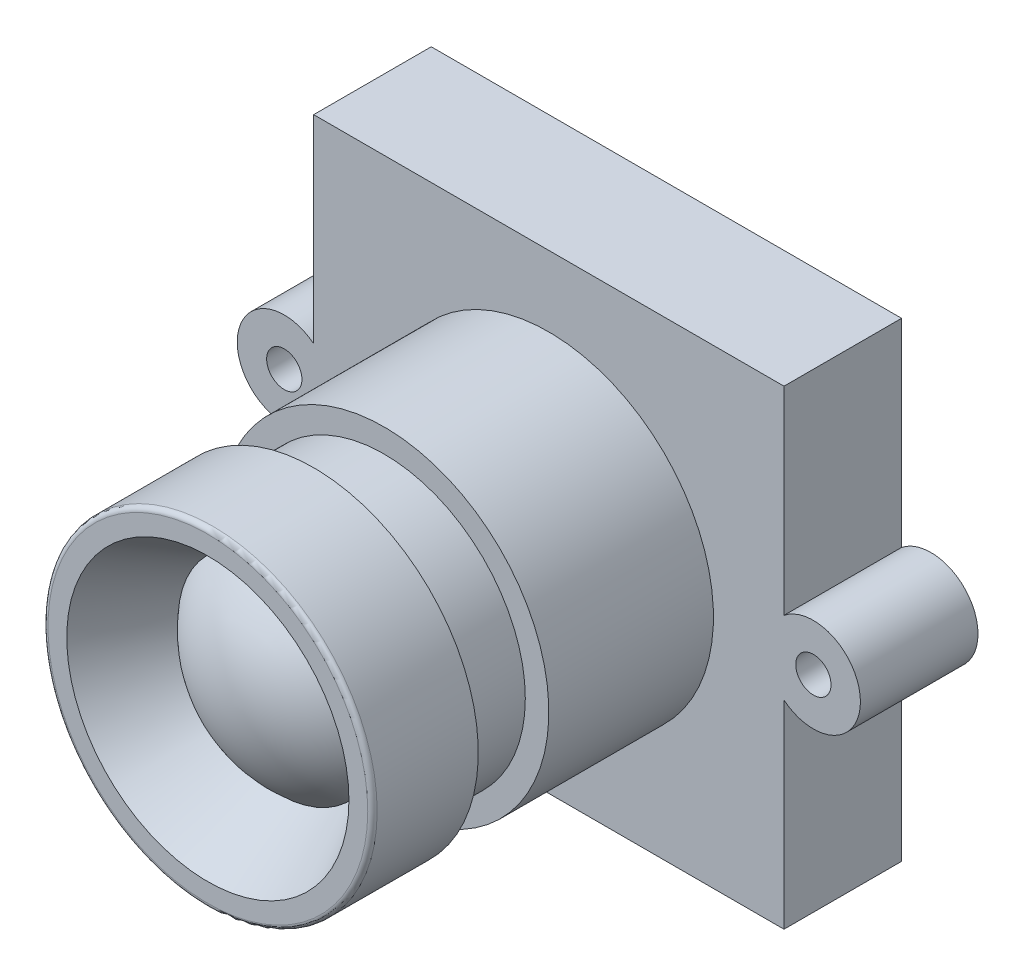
from build123d import *

# Parameters (mm, degrees)
ESQUISSE1_W             = 20
ESQUISSE1_H             = 20
EXTRUSION1_DEPTH        = 5
COQUE1_T                = -1
EXTRUSION2_DEPTH        = 5
ENL_V_MAT_EXTRU_1_REACH = 19.337
ESQUISSE3_R             = 0.75
ESQUISSE4_R             = 7
EXTRUSION3_DEPTH        = 14.5
ESQUISSE5_OUTSIDE_W     = 36.2
ESQUISSE5_OUTSIDE_H     = 29.7
ESQUISSE5_OUTSIDE_R     = 6
ENL_V_MAT_EXTRU_2_DEPTH = 3
ESQUISSE6_R             = 6
ENL_V_MAT_EXTRU_3_DEPTH = 3
ENL_V_MAT_EXTRU_3_DRAFT = -30
D_ME1_FACE_RADIUS       = 4.267949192
D_ME1_HEIGHT            = 2
ESQUISSE7_R             = 6.5
ENL_V_MAT_EXTRU_4_DEPTH = 1
ESQUISSE8_R             = 6
EXTRUSION4_DEPTH        = 0.5
ESQUISSE9_R             = 3
ENL_V_MAT_EXTRU_5_DEPTH = 1.5
ENL_V_MAT_EXTRU_5_DRAFT = -30
CONG_1_R                = 0.2


with BuildPart() as part:
    # Esquisse1 → Extrusion1 (new body)
    with BuildSketch(Plane.XY):
        Rectangle(ESQUISSE1_W, ESQUISSE1_H)
    extrude(amount=EXTRUSION1_DEPTH)

    # Coque1
    coque1_openings = [part.faces().sort_by_distance(p)[0] for p in [
        (0, 0, 0),
    ]]
    offset(amount=COQUE1_T, openings=coque1_openings, kind=Kind.INTERSECTION)

    # Esquisse2 → Extrusion2 (add)
    with BuildSketch(Plane.XY.offset(5)):
        with BuildLine():
            Line((10, -1.5612495), (10, 1.5612495))
            ThreePointArc((10, 1.5612495), (13.25, 0), (10, -1.5612495))
        make_face()
    extrusion2 = extrude(amount=-EXTRUSION2_DEPTH)

    # Esquisse3 → Enl_v. mat.-Extru.1 (cut, up to next)
    with BuildSketch(Plane.XY.offset(5), mode=Mode.PRIVATE) as enl_v_mat_extru_1_sk1:
        with Locations((11.25, 0)):
            Circle(ESQUISSE3_R)
    enl_v_mat_extru_1_tool1 = extrude(enl_v_mat_extru_1_sk1.sketch, amount=-ENL_V_MAT_EXTRU_1_REACH, mode=Mode.PRIVATE) & part.part
    enl_v_mat_extru_1 = enl_v_mat_extru_1_tool1.solids().sort_by_distance((11.25, 0, 5))[0]
    add(enl_v_mat_extru_1, mode=Mode.SUBTRACT)

    # Sym_trie1: Extrusion2, Enl_v. mat.-Extru.1 across plane
    add(extrusion2.mirror(Plane(origin=(0, 0, 0), x_dir=(0, 0, 1), z_dir=(1, 0, 0))))
    add(enl_v_mat_extru_1.mirror(Plane(origin=(0, 0, 0), x_dir=(0, 0, 1), z_dir=(1, 0, 0))), mode=Mode.SUBTRACT)

    # Esquisse4 → Extrusion3 (add)
    with BuildSketch(Plane.XY.offset(5)):
        with Locations(Location((0, 0, 0), (0, 0, 180))):
            Circle(ESQUISSE4_R)
    extrude(amount=EXTRUSION3_DEPTH)

    # Esquisse5 outside → Enl_v. mat.-Extru.2 (cut)
    with BuildSketch(Plane.XY.offset(15)):
        Rectangle(ESQUISSE5_OUTSIDE_W, ESQUISSE5_OUTSIDE_H)
        Circle(ESQUISSE5_OUTSIDE_R, mode=Mode.SUBTRACT)
    extrude(amount=-ENL_V_MAT_EXTRU_2_DEPTH, mode=Mode.SUBTRACT)


with BuildPart() as enl_v_mat_extru_3_tool:
    # Esquisse6 → Enl_v. mat.-Extru.3 (with draft: the straight prism first)
    with BuildSketch(Plane.XY.offset(19.5)):
        Circle(ESQUISSE6_R)
    extrude(amount=-ENL_V_MAT_EXTRU_3_DEPTH)
    # Enl_v. mat.-Extru.3: the draft: its side faces are tilted about the plane it starts from
    enl_v_mat_extru_3_sides = [enl_v_mat_extru_3_tool.faces().sort_by_distance(p)[0] for p in [
        (-6, 0, 18),
    ]]
    draft(enl_v_mat_extru_3_sides, Plane.XY.offset(19.5), ENL_V_MAT_EXTRU_3_DRAFT)


with BuildPart() as part_1:
    add(part.part)

    # Enl_v. mat.-Extru.3: cut by enl_v_mat_extru_3_tool
    add(enl_v_mat_extru_3_tool.part, mode=Mode.SUBTRACT)

    # D_me1: a dome of height H over a round flat face of radius A is a cap of a sphere of radius (A * A + H * H) / (2 * H)
    d_me1_r = (D_ME1_FACE_RADIUS * D_ME1_FACE_RADIUS + D_ME1_HEIGHT * D_ME1_HEIGHT) / (2 * D_ME1_HEIGHT)
    d_me1_base = Plane((0, 0, 16.5), z_dir=(0, 0, 1))
    with Locations(d_me1_base.offset(D_ME1_HEIGHT - d_me1_r)):
        d_me1_ball = Sphere(d_me1_r, mode=Mode.PRIVATE)
    add(split(d_me1_ball, bisect_by=d_me1_base, keep=Keep.TOP, mode=Mode.PRIVATE))

    # Esquisse7 → Enl_v. mat.-Extru.4 (cut)
    with BuildSketch(Plane(origin=(0, 0, 4), x_dir=(-1, 0, 0), z_dir=(0, 0, -1))):
        Circle(ESQUISSE7_R)
    extrude(amount=-ENL_V_MAT_EXTRU_4_DEPTH, mode=Mode.SUBTRACT)

    # Esquisse8 → Extrusion4 (add)
    with BuildSketch(Plane(origin=(0, 0, 5), x_dir=(-1, 0, 0), z_dir=(0, 0, -1))):
        with Locations(Location((0, 0, 0), (0, 0, 180))):
            Circle(ESQUISSE8_R)
    extrude(amount=EXTRUSION4_DEPTH)


with BuildPart() as enl_v_mat_extru_5_tool:
    # Esquisse9 → Enl_v. mat.-Extru.5 (with draft: the straight prism first)
    with BuildSketch(Plane(origin=(0, 0, 4.5), x_dir=(-1, 0, 0), z_dir=(0, 0, -1))):
        Circle(ESQUISSE9_R)
    extrude(amount=-ENL_V_MAT_EXTRU_5_DEPTH)
    # Enl_v. mat.-Extru.5: the draft: its side faces are tilted about the plane it starts from
    enl_v_mat_extru_5_sides = [enl_v_mat_extru_5_tool.faces().sort_by_distance(p)[0] for p in [
        (3, 0, 5.25),
    ]]
    draft(enl_v_mat_extru_5_sides, Plane(origin=(0, 0, 4.5), x_dir=(-1, 0, 0), z_dir=(0, 0, -1)), ENL_V_MAT_EXTRU_5_DRAFT)


with BuildPart() as part_2:
    add(part_1.part)

    # Enl_v. mat.-Extru.5: cut by enl_v_mat_extru_5_tool
    add(enl_v_mat_extru_5_tool.part, mode=Mode.SUBTRACT)

    # Cong_1
    cong_1_edges = [part_2.edges().sort_by_distance(p)[0] for p in [
        (7, 0, 19.5),
    ]]
    fillet(cong_1_edges, radius=CONG_1_R)


solid = part_2.part
